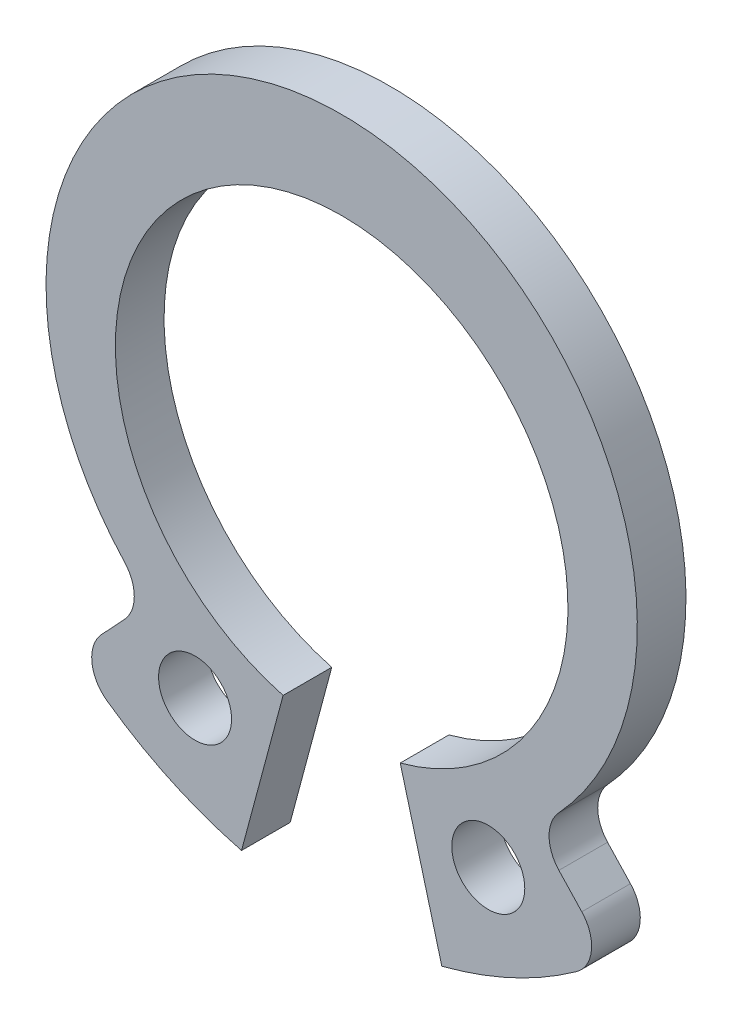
ISO-10303-21;
HEADER;
FILE_DESCRIPTION(('STEP AP214'),'2;1');
FILE_NAME('part.step','',(''),(''),'','','');
FILE_SCHEMA(('AUTOMOTIVE_DESIGN { 1 0 10303 214 1 1 1 1 }'));
ENDSEC;
DATA;
#1=APPLICATION_CONTEXT('core data for automotive mechanical design processes');
#2=APPLICATION_PROTOCOL_DEFINITION('international standard','automotive_design',2000,#1);
#3=PRODUCT_CONTEXT('',#1,'mechanical');
#4=PRODUCT('Part','Part','',(#3));
#5=PRODUCT_RELATED_PRODUCT_CATEGORY('part','',(#4));
#6=PRODUCT_DEFINITION_FORMATION('','',#4);
#7=PRODUCT_DEFINITION_CONTEXT('part definition',#1,'design');
#8=PRODUCT_DEFINITION('design','',#6,#7);
#9=PRODUCT_DEFINITION_SHAPE('','',#8);
#10=(LENGTH_UNIT() NAMED_UNIT(*) SI_UNIT(.MILLI.,.METRE.));
#11=(NAMED_UNIT(*) PLANE_ANGLE_UNIT() SI_UNIT($,.RADIAN.));
#12=(NAMED_UNIT(*) SI_UNIT($,.STERADIAN.) SOLID_ANGLE_UNIT());
#13=UNCERTAINTY_MEASURE_WITH_UNIT(LENGTH_MEASURE(1.E-05),#10,'distance_accuracy_value','');
#14=(GEOMETRIC_REPRESENTATION_CONTEXT(3) GLOBAL_UNCERTAINTY_ASSIGNED_CONTEXT((#13)) GLOBAL_UNIT_ASSIGNED_CONTEXT((#10,
#11,#12)) REPRESENTATION_CONTEXT('',''));
#15=CARTESIAN_POINT('',(0.,0.,0.));
#16=DIRECTION('',(0.,0.,1.));
#17=DIRECTION('',(1.,0.,0.));
#18=AXIS2_PLACEMENT_3D('',#15,#16,#17);
#19=CARTESIAN_POINT('',(-5.01143348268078,-4.25815869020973,1.));
#20=DIRECTION('',(0.,0.,-1.));
#21=DIRECTION('',(-1.,0.,0.));
#22=AXIS2_PLACEMENT_3D('',#19,#20,#21);
#23=PLANE('',#22);
#24=CARTESIAN_POINT('',(3.0125112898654,-5.44411054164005,1.));
#25=DIRECTION('',(0.,0.,1.));
#26=DIRECTION('',(1.,0.,0.));
#27=AXIS2_PLACEMENT_3D('',#24,#25,#26);
#28=CIRCLE('',#27,0.75);
#29=CARTESIAN_POINT('',(3.7625112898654,-5.44411054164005,1.));
#30=VERTEX_POINT('',#29);
#31=EDGE_CURVE('E458',#30,#30,#28,.T.);
#32=ORIENTED_EDGE('',*,*,#31,.F.);
#33=EDGE_LOOP('',(#32));
#34=FACE_BOUND('',#33,.T.);
#35=CARTESIAN_POINT('',(-5.01143348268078,-4.25815869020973,1.));
#36=DIRECTION('',(0.,0.,-1.));
#37=DIRECTION('',(-1.,0.,0.));
#38=AXIS2_PLACEMENT_3D('',#35,#36,#37);
#39=CIRCLE('',#38,0.750000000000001);
#40=CARTESIAN_POINT('',(-4.46072650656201,-3.74902037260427,1.));
#41=VERTEX_POINT('',#40);
#42=CARTESIAN_POINT('',(-4.46378601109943,-4.77058648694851,1.));
#43=VERTEX_POINT('',#42);
#44=EDGE_CURVE('E484',#41,#43,#39,.T.);
#45=ORIENTED_EDGE('',*,*,#44,.T.);
#46=DIRECTION('',(-0.683237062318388,-0.730196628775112,0.));
#47=VECTOR('',#46,1.);
#48=CARTESIAN_POINT('',(-4.46378601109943,-4.77058648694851,1.));
#49=LINE('',#48,#47);
#50=CARTESIAN_POINT('',(-4.93415278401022,-5.27328203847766,1.));
#51=VERTEX_POINT('',#50);
#52=EDGE_CURVE('E453',#43,#51,#49,.T.);
#53=ORIENTED_EDGE('',*,*,#52,.T.);
#54=CARTESIAN_POINT('',(-4.38650531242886,-5.78570983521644,1.));
#55=DIRECTION('',(0.,0.,1.));
#56=DIRECTION('',(-1.,0.,0.));
#57=AXIS2_PLACEMENT_3D('',#54,#55,#56);
#58=CIRCLE('',#57,0.750000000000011);
#59=CARTESIAN_POINT('',(-4.82151402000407,-6.39666599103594,1.));
#60=VERTEX_POINT('',#59);
#61=EDGE_CURVE('E487',#51,#60,#58,.T.);
#62=ORIENTED_EDGE('',*,*,#61,.T.);
#63=CARTESIAN_POINT('',(0.,0.375,1.));
#64=DIRECTION('',(0.,0.,1.));
#65=DIRECTION('',(1.,0.,0.));
#66=AXIS2_PLACEMENT_3D('',#63,#64,#65);
#67=CIRCLE('',#66,8.31278880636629);
#68=CARTESIAN_POINT('',(-2.05761140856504,-7.67911031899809,1.));
#69=VERTEX_POINT('',#68);
#70=EDGE_CURVE('E489',#60,#69,#67,.T.);
#71=ORIENTED_EDGE('',*,*,#70,.T.);
#72=DIRECTION('',(0.258819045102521,0.965925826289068,0.));
#73=VECTOR('',#72,1.);
#74=CARTESIAN_POINT('',(-1.20350855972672,-4.49155509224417,1.));
#75=LINE('',#74,#73);
#76=CARTESIAN_POINT('',(-1.20350855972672,-4.49155509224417,1.));
#77=VERTEX_POINT('',#76);
#78=EDGE_CURVE('E491',#69,#77,#75,.T.);
#79=ORIENTED_EDGE('',*,*,#78,.T.);
#80=CARTESIAN_POINT('',(0.,0.,1.));
#81=DIRECTION('',(0.,0.,-1.));
#82=DIRECTION('',(1.,0.,0.));
#83=AXIS2_PLACEMENT_3D('',#80,#81,#82);
#84=CIRCLE('',#83,4.65);
#85=CARTESIAN_POINT('',(1.20350855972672,-4.49155509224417,1.));
#86=VERTEX_POINT('',#85);
#87=EDGE_CURVE('E493',#77,#86,#84,.T.);
#88=ORIENTED_EDGE('',*,*,#87,.T.);
#89=DIRECTION('',(0.258819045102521,-0.965925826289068,0.));
#90=VECTOR('',#89,1.);
#91=CARTESIAN_POINT('',(1.20350855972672,-4.49155509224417,1.));
#92=LINE('',#91,#90);
#93=CARTESIAN_POINT('',(2.05761140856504,-7.6791103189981,1.));
#94=VERTEX_POINT('',#93);
#95=EDGE_CURVE('E495',#86,#94,#92,.T.);
#96=ORIENTED_EDGE('',*,*,#95,.T.);
#97=CARTESIAN_POINT('',(0.,0.375,1.));
#98=DIRECTION('',(0.,0.,1.));
#99=DIRECTION('',(1.,0.,0.));
#100=AXIS2_PLACEMENT_3D('',#97,#98,#99);
#101=CIRCLE('',#100,8.31278880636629);
#102=CARTESIAN_POINT('',(4.82151402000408,-6.39666599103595,1.));
#103=VERTEX_POINT('',#102);
#104=EDGE_CURVE('E497',#94,#103,#101,.T.);
#105=ORIENTED_EDGE('',*,*,#104,.T.);
#106=CARTESIAN_POINT('',(4.38650531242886,-5.78570983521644,1.));
#107=DIRECTION('',(0.,0.,1.));
#108=DIRECTION('',(1.,0.,0.));
#109=AXIS2_PLACEMENT_3D('',#106,#107,#108);
#110=CIRCLE('',#109,0.750000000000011);
#111=CARTESIAN_POINT('',(4.93415278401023,-5.27328203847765,1.));
#112=VERTEX_POINT('',#111);
#113=EDGE_CURVE('E499',#103,#112,#110,.T.);
#114=ORIENTED_EDGE('',*,*,#113,.T.);
#115=DIRECTION('',(-0.683237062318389,0.730196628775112,0.));
#116=VECTOR('',#115,1.);
#117=CARTESIAN_POINT('',(4.46378601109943,-4.77058648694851,1.));
#118=LINE('',#117,#116);
#119=CARTESIAN_POINT('',(4.46378601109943,-4.77058648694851,1.));
#120=VERTEX_POINT('',#119);
#121=EDGE_CURVE('E501',#112,#120,#118,.T.);
#122=ORIENTED_EDGE('',*,*,#121,.T.);
#123=CARTESIAN_POINT('',(5.01143348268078,-4.25815869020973,1.));
#124=DIRECTION('',(0.,0.,-1.));
#125=DIRECTION('',(1.,0.,0.));
#126=AXIS2_PLACEMENT_3D('',#123,#124,#125);
#127=CIRCLE('',#126,0.750000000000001);
#128=CARTESIAN_POINT('',(4.46072650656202,-3.74902037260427,1.));
#129=VERTEX_POINT('',#128);
#130=EDGE_CURVE('E370',#120,#129,#127,.T.);
#131=ORIENTED_EDGE('',*,*,#130,.T.);
#132=CARTESIAN_POINT('',(0.,0.375,1.));
#133=DIRECTION('',(0.,0.,1.));
#134=DIRECTION('',(1.,0.,0.));
#135=AXIS2_PLACEMENT_3D('',#132,#133,#134);
#136=CIRCLE('',#135,6.075);
#137=EDGE_CURVE('E365',#129,#41,#136,.T.);
#138=ORIENTED_EDGE('',*,*,#137,.T.);
#139=EDGE_LOOP('',(#45,#53,#62,#71,#79,#88,#96,#105,#114,#122,#131,#138));
#140=FACE_BOUND('',#139,.T.);
#141=CARTESIAN_POINT('',(-3.0125112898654,-5.44411054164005,1.));
#142=DIRECTION('',(0.,0.,1.));
#143=DIRECTION('',(-1.,0.,0.));
#144=AXIS2_PLACEMENT_3D('',#141,#142,#143);
#145=CIRCLE('',#144,0.75);
#146=CARTESIAN_POINT('',(-3.7625112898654,-5.44411054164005,1.));
#147=VERTEX_POINT('',#146);
#148=EDGE_CURVE('E604',#147,#147,#145,.T.);
#149=ORIENTED_EDGE('',*,*,#148,.F.);
#150=EDGE_LOOP('',(#149));
#151=FACE_BOUND('',#150,.T.);
#152=ADVANCED_FACE('F350',(#34,#140,#151),#23,.F.);
#153=CARTESIAN_POINT('',(-5.01143348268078,-4.25815869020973,0.));
#154=DIRECTION('',(0.,0.,-1.));
#155=DIRECTION('',(-1.,0.,0.));
#156=AXIS2_PLACEMENT_3D('',#153,#154,#155);
#157=PLANE('',#156);
#158=CARTESIAN_POINT('',(3.0125112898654,-5.44411054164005,0.));
#159=DIRECTION('',(0.,0.,1.));
#160=DIRECTION('',(1.,0.,0.));
#161=AXIS2_PLACEMENT_3D('',#158,#159,#160);
#162=CIRCLE('',#161,0.75);
#163=CARTESIAN_POINT('',(3.7625112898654,-5.44411054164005,0.));
#164=VERTEX_POINT('',#163);
#165=EDGE_CURVE('E461',#164,#164,#162,.T.);
#166=ORIENTED_EDGE('',*,*,#165,.T.);
#167=EDGE_LOOP('',(#166));
#168=FACE_BOUND('',#167,.T.);
#169=CARTESIAN_POINT('',(-5.01143348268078,-4.25815869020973,0.));
#170=DIRECTION('',(0.,0.,-1.));
#171=DIRECTION('',(-1.,0.,0.));
#172=AXIS2_PLACEMENT_3D('',#169,#170,#171);
#173=CIRCLE('',#172,0.750000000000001);
#174=CARTESIAN_POINT('',(-4.46072650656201,-3.74902037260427,0.));
#175=VERTEX_POINT('',#174);
#176=CARTESIAN_POINT('',(-4.46378601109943,-4.77058648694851,0.));
#177=VERTEX_POINT('',#176);
#178=EDGE_CURVE('E444',#175,#177,#173,.T.);
#179=ORIENTED_EDGE('',*,*,#178,.F.);
#180=CARTESIAN_POINT('',(0.,0.375,0.));
#181=DIRECTION('',(0.,0.,1.));
#182=DIRECTION('',(1.,0.,0.));
#183=AXIS2_PLACEMENT_3D('',#180,#181,#182);
#184=CIRCLE('',#183,6.075);
#185=CARTESIAN_POINT('',(4.46072650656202,-3.74902037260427,0.));
#186=VERTEX_POINT('',#185);
#187=EDGE_CURVE('E482',#186,#175,#184,.T.);
#188=ORIENTED_EDGE('',*,*,#187,.F.);
#189=CARTESIAN_POINT('',(5.01143348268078,-4.25815869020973,0.));
#190=DIRECTION('',(0.,0.,-1.));
#191=DIRECTION('',(1.,0.,0.));
#192=AXIS2_PLACEMENT_3D('',#189,#190,#191);
#193=CIRCLE('',#192,0.750000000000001);
#194=CARTESIAN_POINT('',(4.46378601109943,-4.77058648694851,0.));
#195=VERTEX_POINT('',#194);
#196=EDGE_CURVE('E480',#195,#186,#193,.T.);
#197=ORIENTED_EDGE('',*,*,#196,.F.);
#198=DIRECTION('',(-0.683237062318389,0.730196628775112,0.));
#199=VECTOR('',#198,1.);
#200=CARTESIAN_POINT('',(4.46378601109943,-4.77058648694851,0.));
#201=LINE('',#200,#199);
#202=CARTESIAN_POINT('',(4.93415278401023,-5.27328203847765,0.));
#203=VERTEX_POINT('',#202);
#204=EDGE_CURVE('E478',#203,#195,#201,.T.);
#205=ORIENTED_EDGE('',*,*,#204,.F.);
#206=CARTESIAN_POINT('',(4.38650531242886,-5.78570983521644,0.));
#207=DIRECTION('',(0.,0.,1.));
#208=DIRECTION('',(1.,0.,0.));
#209=AXIS2_PLACEMENT_3D('',#206,#207,#208);
#210=CIRCLE('',#209,0.750000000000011);
#211=CARTESIAN_POINT('',(4.82151402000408,-6.39666599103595,0.));
#212=VERTEX_POINT('',#211);
#213=EDGE_CURVE('E476',#212,#203,#210,.T.);
#214=ORIENTED_EDGE('',*,*,#213,.F.);
#215=CARTESIAN_POINT('',(0.,0.375,0.));
#216=DIRECTION('',(0.,0.,1.));
#217=DIRECTION('',(1.,0.,0.));
#218=AXIS2_PLACEMENT_3D('',#215,#216,#217);
#219=CIRCLE('',#218,8.31278880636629);
#220=CARTESIAN_POINT('',(2.05761140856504,-7.6791103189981,0.));
#221=VERTEX_POINT('',#220);
#222=EDGE_CURVE('E474',#221,#212,#219,.T.);
#223=ORIENTED_EDGE('',*,*,#222,.F.);
#224=DIRECTION('',(0.258819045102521,-0.965925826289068,0.));
#225=VECTOR('',#224,1.);
#226=CARTESIAN_POINT('',(1.20350855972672,-4.49155509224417,0.));
#227=LINE('',#226,#225);
#228=CARTESIAN_POINT('',(1.20350855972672,-4.49155509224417,0.));
#229=VERTEX_POINT('',#228);
#230=EDGE_CURVE('E472',#229,#221,#227,.T.);
#231=ORIENTED_EDGE('',*,*,#230,.F.);
#232=CARTESIAN_POINT('',(0.,0.,0.));
#233=DIRECTION('',(0.,0.,-1.));
#234=DIRECTION('',(1.,0.,0.));
#235=AXIS2_PLACEMENT_3D('',#232,#233,#234);
#236=CIRCLE('',#235,4.65);
#237=CARTESIAN_POINT('',(-1.20350855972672,-4.49155509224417,0.));
#238=VERTEX_POINT('',#237);
#239=EDGE_CURVE('E470',#238,#229,#236,.T.);
#240=ORIENTED_EDGE('',*,*,#239,.F.);
#241=DIRECTION('',(0.258819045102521,0.965925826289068,0.));
#242=VECTOR('',#241,1.);
#243=CARTESIAN_POINT('',(-1.20350855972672,-4.49155509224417,0.));
#244=LINE('',#243,#242);
#245=CARTESIAN_POINT('',(-2.05761140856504,-7.67911031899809,0.));
#246=VERTEX_POINT('',#245);
#247=EDGE_CURVE('E468',#246,#238,#244,.T.);
#248=ORIENTED_EDGE('',*,*,#247,.F.);
#249=CARTESIAN_POINT('',(0.,0.375,0.));
#250=DIRECTION('',(0.,0.,1.));
#251=DIRECTION('',(1.,0.,0.));
#252=AXIS2_PLACEMENT_3D('',#249,#250,#251);
#253=CIRCLE('',#252,8.31278880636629);
#254=CARTESIAN_POINT('',(-4.82151402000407,-6.39666599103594,0.));
#255=VERTEX_POINT('',#254);
#256=EDGE_CURVE('E466',#255,#246,#253,.T.);
#257=ORIENTED_EDGE('',*,*,#256,.F.);
#258=CARTESIAN_POINT('',(-4.38650531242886,-5.78570983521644,0.));
#259=DIRECTION('',(0.,0.,1.));
#260=DIRECTION('',(-1.,0.,0.));
#261=AXIS2_PLACEMENT_3D('',#258,#259,#260);
#262=CIRCLE('',#261,0.750000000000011);
#263=CARTESIAN_POINT('',(-4.93415278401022,-5.27328203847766,0.));
#264=VERTEX_POINT('',#263);
#265=EDGE_CURVE('E446',#264,#255,#262,.T.);
#266=ORIENTED_EDGE('',*,*,#265,.F.);
#267=DIRECTION('',(-0.683237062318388,-0.730196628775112,0.));
#268=VECTOR('',#267,1.);
#269=CARTESIAN_POINT('',(-4.46378601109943,-4.77058648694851,0.));
#270=LINE('',#269,#268);
#271=EDGE_CURVE('E439',#177,#264,#270,.T.);
#272=ORIENTED_EDGE('',*,*,#271,.F.);
#273=EDGE_LOOP('',(#179,#188,#197,#205,#214,#223,#231,#240,#248,#257,#266,#272));
#274=FACE_BOUND('',#273,.T.);
#275=CARTESIAN_POINT('',(-3.0125112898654,-5.44411054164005,0.));
#276=DIRECTION('',(0.,0.,1.));
#277=DIRECTION('',(-1.,0.,0.));
#278=AXIS2_PLACEMENT_3D('',#275,#276,#277);
#279=CIRCLE('',#278,0.75);
#280=CARTESIAN_POINT('',(-3.7625112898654,-5.44411054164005,0.));
#281=VERTEX_POINT('',#280);
#282=EDGE_CURVE('E607',#281,#281,#279,.T.);
#283=ORIENTED_EDGE('',*,*,#282,.T.);
#284=EDGE_LOOP('',(#283));
#285=FACE_BOUND('',#284,.T.);
#286=ADVANCED_FACE('F440',(#168,#274,#285),#157,.T.);
#287=CARTESIAN_POINT('',(-5.01143348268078,-4.25815869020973,1.));
#288=DIRECTION('',(0.,0.,-1.));
#289=DIRECTION('',(-1.,0.,0.));
#290=AXIS2_PLACEMENT_3D('',#287,#288,#289);
#291=CYLINDRICAL_SURFACE('',#290,0.750000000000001);
#292=ORIENTED_EDGE('',*,*,#178,.T.);
#293=DIRECTION('',(0.,0.,-1.));
#294=VECTOR('',#293,1.);
#295=CARTESIAN_POINT('',(-4.46378601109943,-4.77058648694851,1.));
#296=LINE('',#295,#294);
#297=EDGE_CURVE('E11',#43,#177,#296,.T.);
#298=ORIENTED_EDGE('',*,*,#297,.F.);
#299=ORIENTED_EDGE('',*,*,#44,.F.);
#300=DIRECTION('',(0.,0.,-1.));
#301=VECTOR('',#300,1.);
#302=CARTESIAN_POINT('',(-4.46072650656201,-3.74902037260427,1.));
#303=LINE('',#302,#301);
#304=EDGE_CURVE('E457',#41,#175,#303,.T.);
#305=ORIENTED_EDGE('',*,*,#304,.T.);
#306=EDGE_LOOP('',(#292,#298,#299,#305));
#307=FACE_BOUND('',#306,.T.);
#308=ADVANCED_FACE('F352',(#307),#291,.F.);
#309=CARTESIAN_POINT('',(-4.46378601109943,-4.77058648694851,1.));
#310=DIRECTION('',(0.730196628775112,-0.683237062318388,0.));
#311=DIRECTION('',(0.683237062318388,0.730196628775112,0.));
#312=AXIS2_PLACEMENT_3D('',#309,#310,#311);
#313=PLANE('',#312);
#314=ORIENTED_EDGE('',*,*,#271,.T.);
#315=DIRECTION('',(0.,0.,-1.));
#316=VECTOR('',#315,1.);
#317=CARTESIAN_POINT('',(-4.93415278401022,-5.27328203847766,1.));
#318=LINE('',#317,#316);
#319=EDGE_CURVE('E358',#51,#264,#318,.T.);
#320=ORIENTED_EDGE('',*,*,#319,.F.);
#321=ORIENTED_EDGE('',*,*,#52,.F.);
#322=ORIENTED_EDGE('',*,*,#297,.T.);
#323=EDGE_LOOP('',(#314,#320,#321,#322));
#324=FACE_BOUND('',#323,.T.);
#325=ADVANCED_FACE('F452',(#324),#313,.F.);
#326=CARTESIAN_POINT('',(-4.38650531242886,-5.78570983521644,1.));
#327=DIRECTION('',(0.,0.,-1.));
#328=DIRECTION('',(-1.,0.,0.));
#329=AXIS2_PLACEMENT_3D('',#326,#327,#328);
#330=CYLINDRICAL_SURFACE('',#329,0.750000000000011);
#331=ORIENTED_EDGE('',*,*,#265,.T.);
#332=DIRECTION('',(0.,0.,-1.));
#333=VECTOR('',#332,1.);
#334=CARTESIAN_POINT('',(-4.82151402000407,-6.39666599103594,1.));
#335=LINE('',#334,#333);
#336=EDGE_CURVE('E530',#60,#255,#335,.T.);
#337=ORIENTED_EDGE('',*,*,#336,.F.);
#338=ORIENTED_EDGE('',*,*,#61,.F.);
#339=ORIENTED_EDGE('',*,*,#319,.T.);
#340=EDGE_LOOP('',(#331,#337,#338,#339));
#341=FACE_BOUND('',#340,.T.);
#342=ADVANCED_FACE('F534',(#341),#330,.T.);
#343=CARTESIAN_POINT('',(0.,0.375,1.));
#344=DIRECTION('',(0.,0.,-1.));
#345=DIRECTION('',(-1.,0.,0.));
#346=AXIS2_PLACEMENT_3D('',#343,#344,#345);
#347=CYLINDRICAL_SURFACE('',#346,8.31278880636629);
#348=ORIENTED_EDGE('',*,*,#256,.T.);
#349=DIRECTION('',(0.,0.,-1.));
#350=VECTOR('',#349,1.);
#351=CARTESIAN_POINT('',(-2.05761140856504,-7.67911031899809,1.));
#352=LINE('',#351,#350);
#353=EDGE_CURVE('E527',#69,#246,#352,.T.);
#354=ORIENTED_EDGE('',*,*,#353,.F.);
#355=ORIENTED_EDGE('',*,*,#70,.F.);
#356=ORIENTED_EDGE('',*,*,#336,.T.);
#357=EDGE_LOOP('',(#348,#354,#355,#356));
#358=FACE_BOUND('',#357,.T.);
#359=ADVANCED_FACE('F542',(#358),#347,.T.);
#360=CARTESIAN_POINT('',(-1.20350855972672,-4.49155509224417,1.));
#361=DIRECTION('',(-0.965925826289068,0.258819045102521,0.));
#362=DIRECTION('',(-0.258819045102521,-0.965925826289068,0.));
#363=AXIS2_PLACEMENT_3D('',#360,#361,#362);
#364=PLANE('',#363);
#365=ORIENTED_EDGE('',*,*,#247,.T.);
#366=DIRECTION('',(0.,0.,-1.));
#367=VECTOR('',#366,1.);
#368=CARTESIAN_POINT('',(-1.20350855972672,-4.49155509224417,1.));
#369=LINE('',#368,#367);
#370=EDGE_CURVE('E524',#77,#238,#369,.T.);
#371=ORIENTED_EDGE('',*,*,#370,.F.);
#372=ORIENTED_EDGE('',*,*,#78,.F.);
#373=ORIENTED_EDGE('',*,*,#353,.T.);
#374=EDGE_LOOP('',(#365,#371,#372,#373));
#375=FACE_BOUND('',#374,.T.);
#376=ADVANCED_FACE('F545',(#375),#364,.F.);
#377=CARTESIAN_POINT('',(0.,0.,1.));
#378=DIRECTION('',(0.,0.,-1.));
#379=DIRECTION('',(-1.,0.,0.));
#380=AXIS2_PLACEMENT_3D('',#377,#378,#379);
#381=CYLINDRICAL_SURFACE('',#380,4.65);
#382=ORIENTED_EDGE('',*,*,#239,.T.);
#383=DIRECTION('',(0.,0.,-1.));
#384=VECTOR('',#383,1.);
#385=CARTESIAN_POINT('',(1.20350855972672,-4.49155509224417,1.));
#386=LINE('',#385,#384);
#387=EDGE_CURVE('E521',#86,#229,#386,.T.);
#388=ORIENTED_EDGE('',*,*,#387,.F.);
#389=ORIENTED_EDGE('',*,*,#87,.F.);
#390=ORIENTED_EDGE('',*,*,#370,.T.);
#391=EDGE_LOOP('',(#382,#388,#389,#390));
#392=FACE_BOUND('',#391,.T.);
#393=ADVANCED_FACE('F550',(#392),#381,.F.);
#394=CARTESIAN_POINT('',(1.20350855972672,-4.49155509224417,1.));
#395=DIRECTION('',(0.965925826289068,0.258819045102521,0.));
#396=DIRECTION('',(-0.258819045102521,0.965925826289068,0.));
#397=AXIS2_PLACEMENT_3D('',#394,#395,#396);
#398=PLANE('',#397);
#399=ORIENTED_EDGE('',*,*,#230,.T.);
#400=DIRECTION('',(0.,0.,-1.));
#401=VECTOR('',#400,1.);
#402=CARTESIAN_POINT('',(2.05761140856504,-7.6791103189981,1.));
#403=LINE('',#402,#401);
#404=EDGE_CURVE('E518',#94,#221,#403,.T.);
#405=ORIENTED_EDGE('',*,*,#404,.F.);
#406=ORIENTED_EDGE('',*,*,#95,.F.);
#407=ORIENTED_EDGE('',*,*,#387,.T.);
#408=EDGE_LOOP('',(#399,#405,#406,#407));
#409=FACE_BOUND('',#408,.T.);
#410=ADVANCED_FACE('F556',(#409),#398,.F.);
#411=CARTESIAN_POINT('',(0.,0.375,1.));
#412=DIRECTION('',(0.,0.,-1.));
#413=DIRECTION('',(-1.,0.,0.));
#414=AXIS2_PLACEMENT_3D('',#411,#412,#413);
#415=CYLINDRICAL_SURFACE('',#414,8.31278880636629);
#416=ORIENTED_EDGE('',*,*,#222,.T.);
#417=DIRECTION('',(0.,0.,-1.));
#418=VECTOR('',#417,1.);
#419=CARTESIAN_POINT('',(4.82151402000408,-6.39666599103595,1.));
#420=LINE('',#419,#418);
#421=EDGE_CURVE('E515',#103,#212,#420,.T.);
#422=ORIENTED_EDGE('',*,*,#421,.F.);
#423=ORIENTED_EDGE('',*,*,#104,.F.);
#424=ORIENTED_EDGE('',*,*,#404,.T.);
#425=EDGE_LOOP('',(#416,#422,#423,#424));
#426=FACE_BOUND('',#425,.T.);
#427=ADVANCED_FACE('F560',(#426),#415,.T.);
#428=CARTESIAN_POINT('',(4.38650531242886,-5.78570983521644,1.));
#429=DIRECTION('',(0.,0.,-1.));
#430=DIRECTION('',(-1.,0.,0.));
#431=AXIS2_PLACEMENT_3D('',#428,#429,#430);
#432=CYLINDRICAL_SURFACE('',#431,0.750000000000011);
#433=ORIENTED_EDGE('',*,*,#213,.T.);
#434=DIRECTION('',(0.,0.,-1.));
#435=VECTOR('',#434,1.);
#436=CARTESIAN_POINT('',(4.93415278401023,-5.27328203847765,1.));
#437=LINE('',#436,#435);
#438=EDGE_CURVE('E512',#112,#203,#437,.T.);
#439=ORIENTED_EDGE('',*,*,#438,.F.);
#440=ORIENTED_EDGE('',*,*,#113,.F.);
#441=ORIENTED_EDGE('',*,*,#421,.T.);
#442=EDGE_LOOP('',(#433,#439,#440,#441));
#443=FACE_BOUND('',#442,.T.);
#444=ADVANCED_FACE('F565',(#443),#432,.T.);
#445=CARTESIAN_POINT('',(4.46378601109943,-4.77058648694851,1.));
#446=DIRECTION('',(-0.730196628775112,-0.683237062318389,0.));
#447=DIRECTION('',(0.683237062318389,-0.730196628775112,0.));
#448=AXIS2_PLACEMENT_3D('',#445,#446,#447);
#449=PLANE('',#448);
#450=ORIENTED_EDGE('',*,*,#204,.T.);
#451=DIRECTION('',(0.,0.,-1.));
#452=VECTOR('',#451,1.);
#453=CARTESIAN_POINT('',(4.46378601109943,-4.77058648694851,1.));
#454=LINE('',#453,#452);
#455=EDGE_CURVE('E509',#120,#195,#454,.T.);
#456=ORIENTED_EDGE('',*,*,#455,.F.);
#457=ORIENTED_EDGE('',*,*,#121,.F.);
#458=ORIENTED_EDGE('',*,*,#438,.T.);
#459=EDGE_LOOP('',(#450,#456,#457,#458));
#460=FACE_BOUND('',#459,.T.);
#461=ADVANCED_FACE('F569',(#460),#449,.F.);
#462=CARTESIAN_POINT('',(5.01143348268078,-4.25815869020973,1.));
#463=DIRECTION('',(0.,0.,-1.));
#464=DIRECTION('',(-1.,0.,0.));
#465=AXIS2_PLACEMENT_3D('',#462,#463,#464);
#466=CYLINDRICAL_SURFACE('',#465,0.750000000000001);
#467=ORIENTED_EDGE('',*,*,#196,.T.);
#468=DIRECTION('',(0.,0.,-1.));
#469=VECTOR('',#468,1.);
#470=CARTESIAN_POINT('',(4.46072650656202,-3.74902037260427,1.));
#471=LINE('',#470,#469);
#472=EDGE_CURVE('E506',#129,#186,#471,.T.);
#473=ORIENTED_EDGE('',*,*,#472,.F.);
#474=ORIENTED_EDGE('',*,*,#130,.F.);
#475=ORIENTED_EDGE('',*,*,#455,.T.);
#476=EDGE_LOOP('',(#467,#473,#474,#475));
#477=FACE_BOUND('',#476,.T.);
#478=ADVANCED_FACE('F573',(#477),#466,.F.);
#479=CARTESIAN_POINT('',(0.,0.375,1.));
#480=DIRECTION('',(0.,0.,-1.));
#481=DIRECTION('',(-1.,0.,0.));
#482=AXIS2_PLACEMENT_3D('',#479,#480,#481);
#483=CYLINDRICAL_SURFACE('',#482,6.075);
#484=ORIENTED_EDGE('',*,*,#187,.T.);
#485=ORIENTED_EDGE('',*,*,#304,.F.);
#486=ORIENTED_EDGE('',*,*,#137,.F.);
#487=ORIENTED_EDGE('',*,*,#472,.T.);
#488=EDGE_LOOP('',(#484,#485,#486,#487));
#489=FACE_BOUND('',#488,.T.);
#490=ADVANCED_FACE('F575',(#489),#483,.T.);
#491=CARTESIAN_POINT('',(3.0125112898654,-5.44411054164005,1.));
#492=DIRECTION('',(0.,0.,-1.));
#493=DIRECTION('',(-1.,0.,0.));
#494=AXIS2_PLACEMENT_3D('',#491,#492,#493);
#495=CYLINDRICAL_SURFACE('',#494,0.75);
#496=ORIENTED_EDGE('',*,*,#31,.T.);
#497=EDGE_LOOP('',(#496));
#498=FACE_BOUND('',#497,.T.);
#499=ORIENTED_EDGE('',*,*,#165,.F.);
#500=EDGE_LOOP('',(#499));
#501=FACE_BOUND('',#500,.T.);
#502=ADVANCED_FACE('F577',(#498,#501),#495,.F.);
#503=CARTESIAN_POINT('',(-3.0125112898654,-5.44411054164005,1.));
#504=DIRECTION('',(0.,0.,-1.));
#505=DIRECTION('',(-1.,0.,0.));
#506=AXIS2_PLACEMENT_3D('',#503,#504,#505);
#507=CYLINDRICAL_SURFACE('',#506,0.75);
#508=ORIENTED_EDGE('',*,*,#148,.T.);
#509=EDGE_LOOP('',(#508));
#510=FACE_BOUND('',#509,.T.);
#511=ORIENTED_EDGE('',*,*,#282,.F.);
#512=EDGE_LOOP('',(#511));
#513=FACE_BOUND('',#512,.T.);
#514=ADVANCED_FACE('F583',(#510,#513),#507,.F.);
#515=CLOSED_SHELL('',(#152,#286,#308,#325,#342,#359,#376,#393,#410,#427,#444,#461,#478,#490,
#502,#514));
#516=MANIFOLD_SOLID_BREP('B2',#515);
#517=ADVANCED_BREP_SHAPE_REPRESENTATION('',(#18,#516),#14);
#518=SHAPE_DEFINITION_REPRESENTATION(#9,#517);
ENDSEC;
END-ISO-10303-21;
